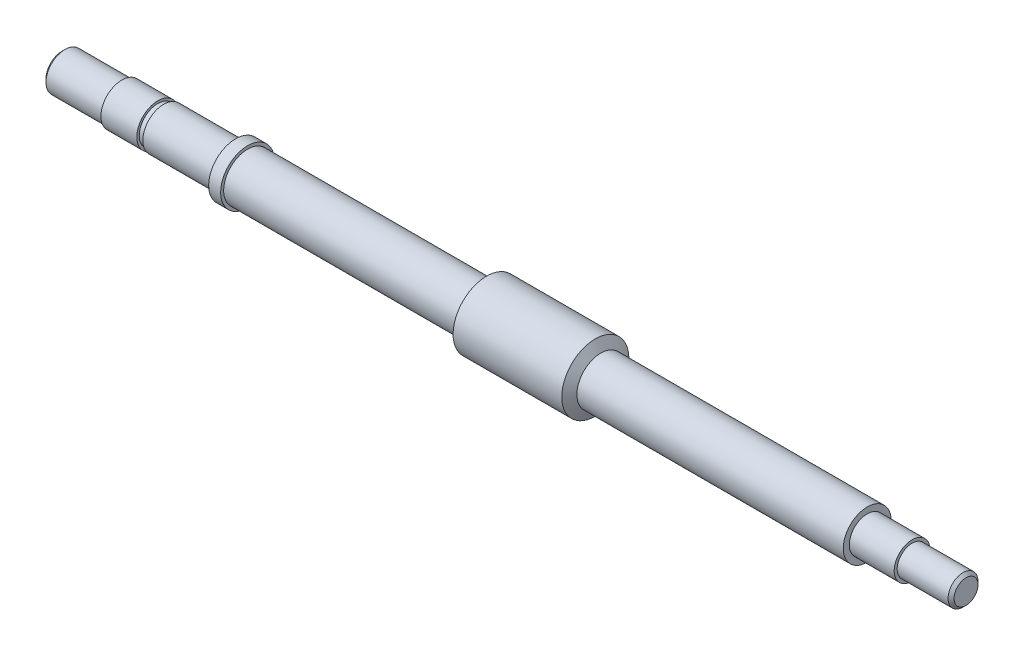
ISO-10303-21;
HEADER;
FILE_DESCRIPTION(('STEP AP214'),'2;1');
FILE_NAME('part.step','',(''),(''),'','','');
FILE_SCHEMA(('AUTOMOTIVE_DESIGN { 1 0 10303 214 1 1 1 1 }'));
ENDSEC;
DATA;
#1=APPLICATION_CONTEXT('core data for automotive mechanical design processes');
#2=APPLICATION_PROTOCOL_DEFINITION('international standard','automotive_design',2000,#1);
#3=PRODUCT_CONTEXT('',#1,'mechanical');
#4=PRODUCT('Part','Part','',(#3));
#5=PRODUCT_RELATED_PRODUCT_CATEGORY('part','',(#4));
#6=PRODUCT_DEFINITION_FORMATION('','',#4);
#7=PRODUCT_DEFINITION_CONTEXT('part definition',#1,'design');
#8=PRODUCT_DEFINITION('design','',#6,#7);
#9=PRODUCT_DEFINITION_SHAPE('','',#8);
#10=(LENGTH_UNIT() NAMED_UNIT(*) SI_UNIT(.MILLI.,.METRE.));
#11=(NAMED_UNIT(*) PLANE_ANGLE_UNIT() SI_UNIT($,.RADIAN.));
#12=(NAMED_UNIT(*) SI_UNIT($,.STERADIAN.) SOLID_ANGLE_UNIT());
#13=UNCERTAINTY_MEASURE_WITH_UNIT(LENGTH_MEASURE(1.E-05),#10,'distance_accuracy_value','');
#14=(GEOMETRIC_REPRESENTATION_CONTEXT(3) GLOBAL_UNCERTAINTY_ASSIGNED_CONTEXT((#13)) GLOBAL_UNIT_ASSIGNED_CONTEXT((#10,
#11,#12)) REPRESENTATION_CONTEXT('',''));
#15=CARTESIAN_POINT('',(0.,0.,0.));
#16=DIRECTION('',(0.,0.,1.));
#17=DIRECTION('',(1.,0.,0.));
#18=AXIS2_PLACEMENT_3D('',#15,#16,#17);
#19=CARTESIAN_POINT('',(-80.,0.,0.));
#20=DIRECTION('',(-1.,0.,0.));
#21=DIRECTION('',(0.,-1.,0.));
#22=AXIS2_PLACEMENT_3D('',#19,#20,#21);
#23=PLANE('',#22);
#24=CARTESIAN_POINT('',(-79.9999999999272,0.,0.));
#25=DIRECTION('',(1.,0.,0.));
#26=DIRECTION('',(0.,0.,-1.));
#27=AXIS2_PLACEMENT_3D('',#24,#25,#26);
#28=CIRCLE('',#27,2.6749999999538);
#29=CARTESIAN_POINT('',(-79.9999999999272,0.,-2.6749999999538));
#30=VERTEX_POINT('',#29);
#31=EDGE_CURVE('E17',#30,#30,#28,.T.);
#32=ORIENTED_EDGE('',*,*,#31,.F.);
#33=EDGE_LOOP('',(#32));
#34=FACE_BOUND('',#33,.T.);
#35=ADVANCED_FACE('F14',(#34),#23,.T.);
#36=CARTESIAN_POINT('',(-79.4999999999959,0.,0.));
#37=DIRECTION('',(1.,0.,0.));
#38=DIRECTION('',(0.,0.,-1.));
#39=AXIS2_PLACEMENT_3D('',#36,#37,#38);
#40=CONICAL_SURFACE('',#39,3.17499999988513,0.785398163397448);
#41=CARTESIAN_POINT('',(-79.5,0.,0.));
#42=DIRECTION('',(-1.,0.,0.));
#43=DIRECTION('',(0.,-1.,0.));
#44=AXIS2_PLACEMENT_3D('',#41,#42,#43);
#45=CIRCLE('',#44,3.175);
#46=CARTESIAN_POINT('',(-79.5,-3.175,0.));
#47=VERTEX_POINT('',#46);
#48=EDGE_CURVE('E45',#47,#47,#45,.F.);
#49=ORIENTED_EDGE('',*,*,#48,.F.);
#50=EDGE_LOOP('',(#49));
#51=FACE_BOUND('',#50,.T.);
#52=ORIENTED_EDGE('',*,*,#31,.T.);
#53=EDGE_LOOP('',(#52));
#54=FACE_BOUND('',#53,.T.);
#55=ADVANCED_FACE('F89',(#51,#54),#40,.T.);
#56=CARTESIAN_POINT('',(78.55,0.,0.));
#57=DIRECTION('',(-1.,0.,0.));
#58=DIRECTION('',(0.,-1.,0.));
#59=AXIS2_PLACEMENT_3D('',#56,#57,#58);
#60=CYLINDRICAL_SURFACE('',#59,3.175);
#61=ORIENTED_EDGE('',*,*,#48,.T.);
#62=EDGE_LOOP('',(#61));
#63=FACE_BOUND('',#62,.T.);
#64=CARTESIAN_POINT('',(-70.,0.,0.));
#65=DIRECTION('',(-1.,0.,0.));
#66=DIRECTION('',(0.,-1.,0.));
#67=AXIS2_PLACEMENT_3D('',#64,#65,#66);
#68=CIRCLE('',#67,3.175);
#69=CARTESIAN_POINT('',(-70.,-3.175,0.));
#70=VERTEX_POINT('',#69);
#71=EDGE_CURVE('E47',#70,#70,#68,.F.);
#72=ORIENTED_EDGE('',*,*,#71,.F.);
#73=EDGE_LOOP('',(#72));
#74=FACE_BOUND('',#73,.T.);
#75=ADVANCED_FACE('F87',(#63,#74),#60,.T.);
#76=CARTESIAN_POINT('',(-70.,0.,0.));
#77=DIRECTION('',(-1.,0.,0.));
#78=DIRECTION('',(0.,-1.,0.));
#79=AXIS2_PLACEMENT_3D('',#76,#77,#78);
#80=PLANE('',#79);
#81=CARTESIAN_POINT('',(-70.,0.,0.));
#82=DIRECTION('',(-1.,0.,0.));
#83=DIRECTION('',(0.,-1.,0.));
#84=AXIS2_PLACEMENT_3D('',#81,#82,#83);
#85=CIRCLE('',#84,3.5);
#86=CARTESIAN_POINT('',(-70.,-3.5,0.));
#87=VERTEX_POINT('',#86);
#88=EDGE_CURVE('E80',#87,#87,#85,.F.);
#89=ORIENTED_EDGE('',*,*,#88,.F.);
#90=EDGE_LOOP('',(#89));
#91=FACE_BOUND('',#90,.T.);
#92=ORIENTED_EDGE('',*,*,#71,.T.);
#93=EDGE_LOOP('',(#92));
#94=FACE_BOUND('',#93,.T.);
#95=ADVANCED_FACE('F85',(#91,#94),#80,.T.);
#96=CARTESIAN_POINT('',(78.55,0.,0.));
#97=DIRECTION('',(-1.,0.,0.));
#98=DIRECTION('',(0.,-1.,0.));
#99=AXIS2_PLACEMENT_3D('',#96,#97,#98);
#100=CYLINDRICAL_SURFACE('',#99,3.5);
#101=ORIENTED_EDGE('',*,*,#88,.T.);
#102=EDGE_LOOP('',(#101));
#103=FACE_BOUND('',#102,.T.);
#104=CARTESIAN_POINT('',(-64.,0.,0.));
#105=DIRECTION('',(-1.,0.,0.));
#106=DIRECTION('',(0.,-1.,0.));
#107=AXIS2_PLACEMENT_3D('',#104,#105,#106);
#108=CIRCLE('',#107,3.5);
#109=CARTESIAN_POINT('',(-64.,-3.5,0.));
#110=VERTEX_POINT('',#109);
#111=EDGE_CURVE('E77',#110,#110,#108,.T.);
#112=ORIENTED_EDGE('',*,*,#111,.T.);
#113=EDGE_LOOP('',(#112));
#114=FACE_BOUND('',#113,.T.);
#115=ADVANCED_FACE('F97',(#103,#114),#100,.T.);
#116=CARTESIAN_POINT('',(-64.,0.,0.));
#117=DIRECTION('',(-1.,0.,0.));
#118=DIRECTION('',(0.,-1.,0.));
#119=AXIS2_PLACEMENT_3D('',#116,#117,#118);
#120=PLANE('',#119);
#121=ORIENTED_EDGE('',*,*,#111,.F.);
#122=EDGE_LOOP('',(#121));
#123=FACE_BOUND('',#122,.T.);
#124=CARTESIAN_POINT('',(-64.,0.,0.));
#125=DIRECTION('',(-1.,0.,0.));
#126=DIRECTION('',(0.,-1.,0.));
#127=AXIS2_PLACEMENT_3D('',#124,#125,#126);
#128=CIRCLE('',#127,3.1);
#129=CARTESIAN_POINT('',(-64.,-3.1,0.));
#130=VERTEX_POINT('',#129);
#131=EDGE_CURVE('E74',#130,#130,#128,.F.);
#132=ORIENTED_EDGE('',*,*,#131,.F.);
#133=EDGE_LOOP('',(#132));
#134=FACE_BOUND('',#133,.T.);
#135=ADVANCED_FACE('F171',(#123,#134),#120,.F.);
#136=CARTESIAN_POINT('',(78.55,0.,0.));
#137=DIRECTION('',(-1.,0.,0.));
#138=DIRECTION('',(0.,-1.,0.));
#139=AXIS2_PLACEMENT_3D('',#136,#137,#138);
#140=CYLINDRICAL_SURFACE('',#139,3.1);
#141=ORIENTED_EDGE('',*,*,#131,.T.);
#142=EDGE_LOOP('',(#141));
#143=FACE_BOUND('',#142,.T.);
#144=CARTESIAN_POINT('',(-63.,0.,0.));
#145=DIRECTION('',(-1.,0.,0.));
#146=DIRECTION('',(0.,-1.,0.));
#147=AXIS2_PLACEMENT_3D('',#144,#145,#146);
#148=CIRCLE('',#147,3.1);
#149=CARTESIAN_POINT('',(-63.,-3.1,0.));
#150=VERTEX_POINT('',#149);
#151=EDGE_CURVE('E71',#150,#150,#148,.F.);
#152=ORIENTED_EDGE('',*,*,#151,.F.);
#153=EDGE_LOOP('',(#152));
#154=FACE_BOUND('',#153,.T.);
#155=ADVANCED_FACE('F167',(#143,#154),#140,.T.);
#156=CARTESIAN_POINT('',(-63.,0.,0.));
#157=DIRECTION('',(-1.,0.,0.));
#158=DIRECTION('',(0.,-1.,0.));
#159=AXIS2_PLACEMENT_3D('',#156,#157,#158);
#160=PLANE('',#159);
#161=CARTESIAN_POINT('',(-63.,0.,0.));
#162=DIRECTION('',(-1.,0.,0.));
#163=DIRECTION('',(0.,-1.,0.));
#164=AXIS2_PLACEMENT_3D('',#161,#162,#163);
#165=CIRCLE('',#164,3.5);
#166=CARTESIAN_POINT('',(-63.,-3.5,0.));
#167=VERTEX_POINT('',#166);
#168=EDGE_CURVE('E68',#167,#167,#165,.F.);
#169=ORIENTED_EDGE('',*,*,#168,.F.);
#170=EDGE_LOOP('',(#169));
#171=FACE_BOUND('',#170,.T.);
#172=ORIENTED_EDGE('',*,*,#151,.T.);
#173=EDGE_LOOP('',(#172));
#174=FACE_BOUND('',#173,.T.);
#175=ADVANCED_FACE('F163',(#171,#174),#160,.T.);
#176=CARTESIAN_POINT('',(78.55,0.,0.));
#177=DIRECTION('',(-1.,0.,0.));
#178=DIRECTION('',(0.,-1.,0.));
#179=AXIS2_PLACEMENT_3D('',#176,#177,#178);
#180=CYLINDRICAL_SURFACE('',#179,3.5);
#181=ORIENTED_EDGE('',*,*,#168,.T.);
#182=EDGE_LOOP('',(#181));
#183=FACE_BOUND('',#182,.T.);
#184=CARTESIAN_POINT('',(-51.,0.,0.));
#185=DIRECTION('',(-1.,0.,0.));
#186=DIRECTION('',(0.,-1.,0.));
#187=AXIS2_PLACEMENT_3D('',#184,#185,#186);
#188=CIRCLE('',#187,3.5);
#189=CARTESIAN_POINT('',(-51.,-3.5,0.));
#190=VERTEX_POINT('',#189);
#191=EDGE_CURVE('E65',#190,#190,#188,.F.);
#192=ORIENTED_EDGE('',*,*,#191,.F.);
#193=EDGE_LOOP('',(#192));
#194=FACE_BOUND('',#193,.T.);
#195=ADVANCED_FACE('F159',(#183,#194),#180,.T.);
#196=CARTESIAN_POINT('',(-51.,0.,0.));
#197=DIRECTION('',(-1.,0.,0.));
#198=DIRECTION('',(0.,-1.,0.));
#199=AXIS2_PLACEMENT_3D('',#196,#197,#198);
#200=PLANE('',#199);
#201=CARTESIAN_POINT('',(-51.,0.,0.));
#202=DIRECTION('',(-1.,0.,0.));
#203=DIRECTION('',(0.,-1.,0.));
#204=AXIS2_PLACEMENT_3D('',#201,#202,#203);
#205=CIRCLE('',#204,4.5);
#206=CARTESIAN_POINT('',(-51.,-4.5,0.));
#207=VERTEX_POINT('',#206);
#208=EDGE_CURVE('E62',#207,#207,#205,.F.);
#209=ORIENTED_EDGE('',*,*,#208,.F.);
#210=EDGE_LOOP('',(#209));
#211=FACE_BOUND('',#210,.T.);
#212=ORIENTED_EDGE('',*,*,#191,.T.);
#213=EDGE_LOOP('',(#212));
#214=FACE_BOUND('',#213,.T.);
#215=ADVANCED_FACE('F155',(#211,#214),#200,.T.);
#216=CARTESIAN_POINT('',(71.,0.,0.));
#217=DIRECTION('',(-1.,0.,0.));
#218=DIRECTION('',(0.,-1.,0.));
#219=AXIS2_PLACEMENT_3D('',#216,#217,#218);
#220=PLANE('',#219);
#221=CARTESIAN_POINT('',(71.0000000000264,0.,0.));
#222=DIRECTION('',(-1.,0.,0.));
#223=DIRECTION('',(0.,0.,1.));
#224=AXIS2_PLACEMENT_3D('',#221,#222,#223);
#225=CIRCLE('',#224,2.00000000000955);
#226=CARTESIAN_POINT('',(71.0000000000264,0.,2.00000000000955));
#227=VERTEX_POINT('',#226);
#228=EDGE_CURVE('E59',#227,#227,#225,.T.);
#229=ORIENTED_EDGE('',*,*,#228,.F.);
#230=EDGE_LOOP('',(#229));
#231=FACE_BOUND('',#230,.T.);
#232=ADVANCED_FACE('F151',(#231),#220,.F.);
#233=CARTESIAN_POINT('',(78.55,0.,0.));
#234=DIRECTION('',(-1.,0.,0.));
#235=DIRECTION('',(0.,-1.,0.));
#236=AXIS2_PLACEMENT_3D('',#233,#234,#235);
#237=CYLINDRICAL_SURFACE('',#236,4.5);
#238=ORIENTED_EDGE('',*,*,#208,.T.);
#239=EDGE_LOOP('',(#238));
#240=FACE_BOUND('',#239,.T.);
#241=CARTESIAN_POINT('',(-49.,0.,0.));
#242=DIRECTION('',(-1.,0.,0.));
#243=DIRECTION('',(0.,-1.,0.));
#244=AXIS2_PLACEMENT_3D('',#241,#242,#243);
#245=CIRCLE('',#244,4.5);
#246=CARTESIAN_POINT('',(-49.,-4.5,0.));
#247=VERTEX_POINT('',#246);
#248=EDGE_CURVE('E44',#247,#247,#245,.T.);
#249=ORIENTED_EDGE('',*,*,#248,.T.);
#250=EDGE_LOOP('',(#249));
#251=FACE_BOUND('',#250,.T.);
#252=ADVANCED_FACE('F147',(#240,#251),#237,.T.);
#253=CARTESIAN_POINT('',(70.5000000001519,0.,0.));
#254=DIRECTION('',(-1.,0.,0.));
#255=DIRECTION('',(0.,0.,1.));
#256=AXIS2_PLACEMENT_3D('',#253,#254,#255);
#257=CONICAL_SURFACE('',#256,2.49999999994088,0.785398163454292);
#258=ORIENTED_EDGE('',*,*,#228,.T.);
#259=EDGE_LOOP('',(#258));
#260=FACE_BOUND('',#259,.T.);
#261=CARTESIAN_POINT('',(70.5,0.,0.));
#262=DIRECTION('',(-1.,0.,0.));
#263=DIRECTION('',(0.,-1.,0.));
#264=AXIS2_PLACEMENT_3D('',#261,#262,#263);
#265=CIRCLE('',#264,2.5);
#266=CARTESIAN_POINT('',(70.5,-2.5,0.));
#267=VERTEX_POINT('',#266);
#268=EDGE_CURVE('E40',#267,#267,#265,.T.);
#269=ORIENTED_EDGE('',*,*,#268,.F.);
#270=EDGE_LOOP('',(#269));
#271=FACE_BOUND('',#270,.T.);
#272=ADVANCED_FACE('F143',(#260,#271),#257,.T.);
#273=CARTESIAN_POINT('',(-49.,0.,0.));
#274=DIRECTION('',(-1.,0.,0.));
#275=DIRECTION('',(0.,-1.,0.));
#276=AXIS2_PLACEMENT_3D('',#273,#274,#275);
#277=PLANE('',#276);
#278=ORIENTED_EDGE('',*,*,#248,.F.);
#279=EDGE_LOOP('',(#278));
#280=FACE_BOUND('',#279,.T.);
#281=CARTESIAN_POINT('',(-49.,0.,0.));
#282=DIRECTION('',(-1.,0.,0.));
#283=DIRECTION('',(0.,-1.,0.));
#284=AXIS2_PLACEMENT_3D('',#281,#282,#283);
#285=CIRCLE('',#284,4.);
#286=CARTESIAN_POINT('',(-49.,-4.,0.));
#287=VERTEX_POINT('',#286);
#288=EDGE_CURVE('E43',#287,#287,#285,.F.);
#289=ORIENTED_EDGE('',*,*,#288,.F.);
#290=EDGE_LOOP('',(#289));
#291=FACE_BOUND('',#290,.T.);
#292=ADVANCED_FACE('F139',(#280,#291),#277,.F.);
#293=CARTESIAN_POINT('',(78.55,0.,0.));
#294=DIRECTION('',(-1.,0.,0.));
#295=DIRECTION('',(0.,-1.,0.));
#296=AXIS2_PLACEMENT_3D('',#293,#294,#295);
#297=CYLINDRICAL_SURFACE('',#296,2.5);
#298=ORIENTED_EDGE('',*,*,#268,.T.);
#299=EDGE_LOOP('',(#298));
#300=FACE_BOUND('',#299,.T.);
#301=CARTESIAN_POINT('',(62.,0.,0.));
#302=DIRECTION('',(-1.,0.,0.));
#303=DIRECTION('',(0.,-1.,0.));
#304=AXIS2_PLACEMENT_3D('',#301,#302,#303);
#305=CIRCLE('',#304,2.5);
#306=CARTESIAN_POINT('',(62.,-2.5,0.));
#307=VERTEX_POINT('',#306);
#308=EDGE_CURVE('E39',#307,#307,#305,.F.);
#309=ORIENTED_EDGE('',*,*,#308,.T.);
#310=EDGE_LOOP('',(#309));
#311=FACE_BOUND('',#310,.T.);
#312=ADVANCED_FACE('F135',(#300,#311),#297,.T.);
#313=CARTESIAN_POINT('',(78.55,0.,0.));
#314=DIRECTION('',(-1.,0.,0.));
#315=DIRECTION('',(0.,-1.,0.));
#316=AXIS2_PLACEMENT_3D('',#313,#314,#315);
#317=CYLINDRICAL_SURFACE('',#316,4.);
#318=ORIENTED_EDGE('',*,*,#288,.T.);
#319=EDGE_LOOP('',(#318));
#320=FACE_BOUND('',#319,.T.);
#321=CARTESIAN_POINT('',(-9.99999999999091,0.,0.));
#322=DIRECTION('',(1.,0.,0.));
#323=DIRECTION('',(0.,0.,-1.));
#324=AXIS2_PLACEMENT_3D('',#321,#322,#323);
#325=CIRCLE('',#324,4.0000000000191);
#326=CARTESIAN_POINT('',(-9.99999999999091,0.,-4.0000000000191));
#327=VERTEX_POINT('',#326);
#328=EDGE_CURVE('E36',#327,#327,#325,.T.);
#329=ORIENTED_EDGE('',*,*,#328,.F.);
#330=EDGE_LOOP('',(#329));
#331=FACE_BOUND('',#330,.T.);
#332=ADVANCED_FACE('F131',(#320,#331),#317,.T.);
#333=CARTESIAN_POINT('',(62.,0.,0.));
#334=DIRECTION('',(-1.,0.,0.));
#335=DIRECTION('',(0.,-1.,0.));
#336=AXIS2_PLACEMENT_3D('',#333,#334,#335);
#337=PLANE('',#336);
#338=CARTESIAN_POINT('',(62.,0.,0.));
#339=DIRECTION('',(-1.,0.,0.));
#340=DIRECTION('',(0.,-1.,0.));
#341=AXIS2_PLACEMENT_3D('',#338,#339,#340);
#342=CIRCLE('',#341,3.);
#343=CARTESIAN_POINT('',(62.,-3.,0.));
#344=VERTEX_POINT('',#343);
#345=EDGE_CURVE('E35',#344,#344,#342,.T.);
#346=ORIENTED_EDGE('',*,*,#345,.F.);
#347=EDGE_LOOP('',(#346));
#348=FACE_BOUND('',#347,.T.);
#349=ORIENTED_EDGE('',*,*,#308,.F.);
#350=EDGE_LOOP('',(#349));
#351=FACE_BOUND('',#350,.T.);
#352=ADVANCED_FACE('F127',(#348,#351),#337,.F.);
#353=CARTESIAN_POINT('',(-9.07623956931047,0.,0.));
#354=DIRECTION('',(1.,0.,0.));
#355=DIRECTION('',(0.,0.,-1.));
#356=AXIS2_PLACEMENT_3D('',#353,#354,#355);
#357=CONICAL_SURFACE('',#356,5.59999999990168,1.04719755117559);
#358=CARTESIAN_POINT('',(-9.076239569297,0.,0.));
#359=DIRECTION('',(-1.,0.,0.));
#360=DIRECTION('',(0.,-1.,0.));
#361=AXIS2_PLACEMENT_3D('',#358,#359,#360);
#362=CIRCLE('',#361,5.6);
#363=CARTESIAN_POINT('',(-9.076239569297,-5.6,0.));
#364=VERTEX_POINT('',#363);
#365=EDGE_CURVE('E32',#364,#364,#362,.F.);
#366=ORIENTED_EDGE('',*,*,#365,.F.);
#367=EDGE_LOOP('',(#366));
#368=FACE_BOUND('',#367,.T.);
#369=ORIENTED_EDGE('',*,*,#328,.T.);
#370=EDGE_LOOP('',(#369));
#371=FACE_BOUND('',#370,.T.);
#372=ADVANCED_FACE('F123',(#368,#371),#357,.T.);
#373=CARTESIAN_POINT('',(78.55,0.,0.));
#374=DIRECTION('',(-1.,0.,0.));
#375=DIRECTION('',(0.,-1.,0.));
#376=AXIS2_PLACEMENT_3D('',#373,#374,#375);
#377=CYLINDRICAL_SURFACE('',#376,3.);
#378=ORIENTED_EDGE('',*,*,#345,.T.);
#379=EDGE_LOOP('',(#378));
#380=FACE_BOUND('',#379,.T.);
#381=CARTESIAN_POINT('',(54.5,0.,0.));
#382=DIRECTION('',(-1.,0.,0.));
#383=DIRECTION('',(0.,-1.,0.));
#384=AXIS2_PLACEMENT_3D('',#381,#382,#383);
#385=CIRCLE('',#384,3.);
#386=CARTESIAN_POINT('',(54.5,-3.,0.));
#387=VERTEX_POINT('',#386);
#388=EDGE_CURVE('E31',#387,#387,#385,.F.);
#389=ORIENTED_EDGE('',*,*,#388,.T.);
#390=EDGE_LOOP('',(#389));
#391=FACE_BOUND('',#390,.T.);
#392=ADVANCED_FACE('F119',(#380,#391),#377,.T.);
#393=CARTESIAN_POINT('',(78.55,0.,0.));
#394=DIRECTION('',(-1.,0.,0.));
#395=DIRECTION('',(0.,-1.,0.));
#396=AXIS2_PLACEMENT_3D('',#393,#394,#395);
#397=CYLINDRICAL_SURFACE('',#396,5.6);
#398=ORIENTED_EDGE('',*,*,#365,.T.);
#399=EDGE_LOOP('',(#398));
#400=FACE_BOUND('',#399,.T.);
#401=CARTESIAN_POINT('',(9.07623956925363,0.,0.));
#402=DIRECTION('',(-1.,0.,0.));
#403=DIRECTION('',(0.,0.,1.));
#404=AXIS2_PLACEMENT_3D('',#401,#402,#403);
#405=CIRCLE('',#404,5.59999999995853);
#406=CARTESIAN_POINT('',(9.07623956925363,0.,5.59999999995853));
#407=VERTEX_POINT('',#406);
#408=EDGE_CURVE('E26',#407,#407,#405,.F.);
#409=ORIENTED_EDGE('',*,*,#408,.F.);
#410=EDGE_LOOP('',(#409));
#411=FACE_BOUND('',#410,.T.);
#412=ADVANCED_FACE('F115',(#400,#411),#397,.T.);
#413=CARTESIAN_POINT('',(54.5,0.,0.));
#414=DIRECTION('',(-1.,0.,0.));
#415=DIRECTION('',(0.,-1.,0.));
#416=AXIS2_PLACEMENT_3D('',#413,#414,#415);
#417=PLANE('',#416);
#418=CARTESIAN_POINT('',(54.5,0.,0.));
#419=DIRECTION('',(-1.,0.,0.));
#420=DIRECTION('',(0.,-1.,0.));
#421=AXIS2_PLACEMENT_3D('',#418,#419,#420);
#422=CIRCLE('',#421,4.);
#423=CARTESIAN_POINT('',(54.5,-4.,0.));
#424=VERTEX_POINT('',#423);
#425=EDGE_CURVE('E21',#424,#424,#422,.T.);
#426=ORIENTED_EDGE('',*,*,#425,.F.);
#427=EDGE_LOOP('',(#426));
#428=FACE_BOUND('',#427,.T.);
#429=ORIENTED_EDGE('',*,*,#388,.F.);
#430=EDGE_LOOP('',(#429));
#431=FACE_BOUND('',#430,.T.);
#432=ADVANCED_FACE('F108',(#428,#431),#417,.F.);
#433=CARTESIAN_POINT('',(9.07623956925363,0.,0.));
#434=DIRECTION('',(-1.,0.,0.));
#435=DIRECTION('',(0.,0.,1.));
#436=AXIS2_PLACEMENT_3D('',#433,#434,#435);
#437=CONICAL_SURFACE('',#436,5.59999999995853,1.04719755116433);
#438=ORIENTED_EDGE('',*,*,#408,.T.);
#439=EDGE_LOOP('',(#438));
#440=FACE_BOUND('',#439,.T.);
#441=CARTESIAN_POINT('',(9.99999999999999,0.,0.));
#442=DIRECTION('',(-1.,0.,0.));
#443=DIRECTION('',(0.,-1.,0.));
#444=AXIS2_PLACEMENT_3D('',#441,#442,#443);
#445=CIRCLE('',#444,4.);
#446=CARTESIAN_POINT('',(9.99999999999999,-4.,0.));
#447=VERTEX_POINT('',#446);
#448=EDGE_CURVE('E10',#447,#447,#445,.F.);
#449=ORIENTED_EDGE('',*,*,#448,.F.);
#450=EDGE_LOOP('',(#449));
#451=FACE_BOUND('',#450,.T.);
#452=ADVANCED_FACE('F103',(#440,#451),#437,.T.);
#453=CARTESIAN_POINT('',(78.55,0.,0.));
#454=DIRECTION('',(-1.,0.,0.));
#455=DIRECTION('',(0.,-1.,0.));
#456=AXIS2_PLACEMENT_3D('',#453,#454,#455);
#457=CYLINDRICAL_SURFACE('',#456,4.);
#458=ORIENTED_EDGE('',*,*,#448,.T.);
#459=EDGE_LOOP('',(#458));
#460=FACE_BOUND('',#459,.T.);
#461=ORIENTED_EDGE('',*,*,#425,.T.);
#462=EDGE_LOOP('',(#461));
#463=FACE_BOUND('',#462,.T.);
#464=ADVANCED_FACE('F101',(#460,#463),#457,.T.);
#465=CLOSED_SHELL('',(#35,#55,#75,#95,#115,#135,#155,#175,#195,#215,#232,#252,#272,#292,#312,
#332,#352,#372,#392,#412,#432,#452,#464));
#466=MANIFOLD_SOLID_BREP('B1',#465);
#467=ADVANCED_BREP_SHAPE_REPRESENTATION('',(#18,#466),#14);
#468=SHAPE_DEFINITION_REPRESENTATION(#9,#467);
ENDSEC;
END-ISO-10303-21;
